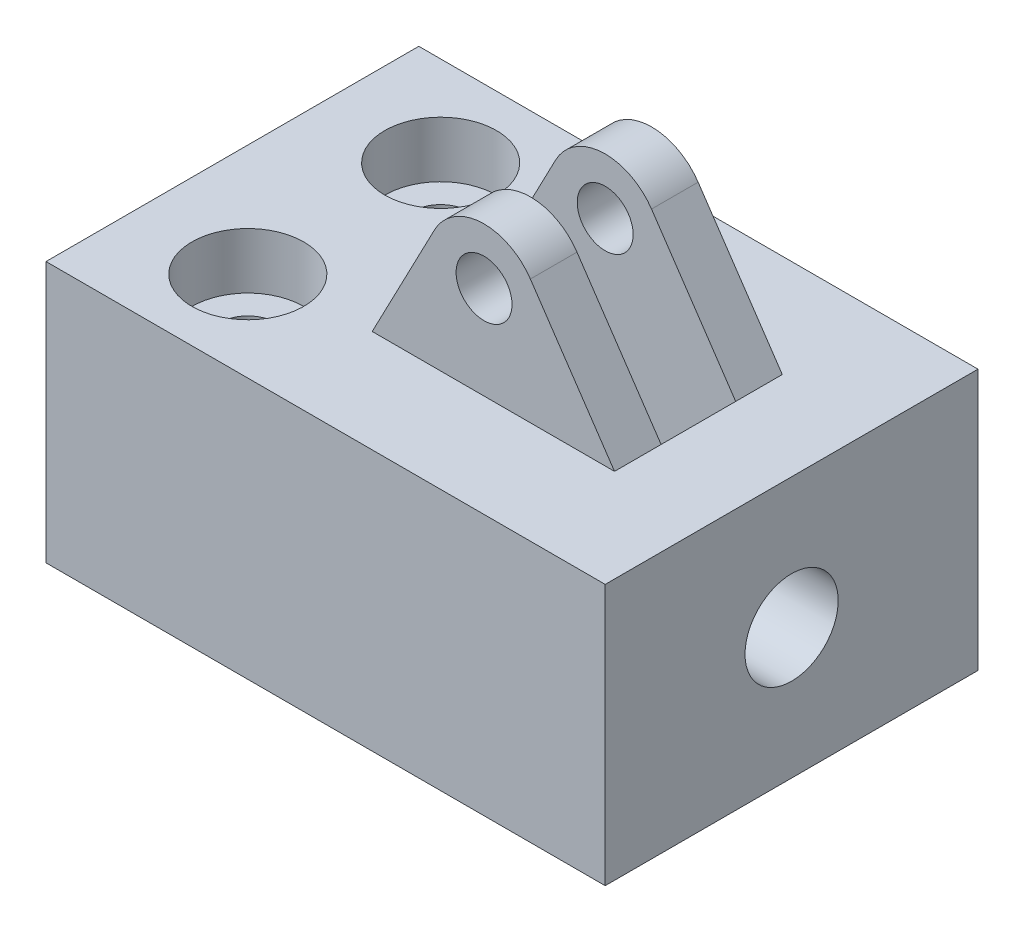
ISO-10303-21;
HEADER;
FILE_DESCRIPTION(('STEP AP214'),'2;1');
FILE_NAME('part.step','',(''),(''),'','','');
FILE_SCHEMA(('AUTOMOTIVE_DESIGN { 1 0 10303 214 1 1 1 1 }'));
ENDSEC;
DATA;
#1=APPLICATION_CONTEXT('core data for automotive mechanical design processes');
#2=APPLICATION_PROTOCOL_DEFINITION('international standard','automotive_design',2000,#1);
#3=PRODUCT_CONTEXT('',#1,'mechanical');
#4=PRODUCT('Part','Part','',(#3));
#5=PRODUCT_RELATED_PRODUCT_CATEGORY('part','',(#4));
#6=PRODUCT_DEFINITION_FORMATION('','',#4);
#7=PRODUCT_DEFINITION_CONTEXT('part definition',#1,'design');
#8=PRODUCT_DEFINITION('design','',#6,#7);
#9=PRODUCT_DEFINITION_SHAPE('','',#8);
#10=(LENGTH_UNIT() NAMED_UNIT(*) SI_UNIT(.MILLI.,.METRE.));
#11=(NAMED_UNIT(*) PLANE_ANGLE_UNIT() SI_UNIT($,.RADIAN.));
#12=(NAMED_UNIT(*) SI_UNIT($,.STERADIAN.) SOLID_ANGLE_UNIT());
#13=UNCERTAINTY_MEASURE_WITH_UNIT(LENGTH_MEASURE(1.E-05),#10,'distance_accuracy_value','');
#14=(GEOMETRIC_REPRESENTATION_CONTEXT(3) GLOBAL_UNCERTAINTY_ASSIGNED_CONTEXT((#13)) GLOBAL_UNIT_ASSIGNED_CONTEXT((#10,
#11,#12)) REPRESENTATION_CONTEXT('',''));
#15=CARTESIAN_POINT('',(0.,0.,0.));
#16=DIRECTION('',(0.,0.,1.));
#17=DIRECTION('',(1.,0.,0.));
#18=AXIS2_PLACEMENT_3D('',#15,#16,#17);
#19=CARTESIAN_POINT('',(-30.,14.,-20.));
#20=DIRECTION('',(0.,1.,0.));
#21=DIRECTION('',(0.,0.,1.));
#22=AXIS2_PLACEMENT_3D('',#19,#20,#21);
#23=PLANE('',#22);
#24=DIRECTION('',(0.,0.,1.));
#25=VECTOR('',#24,1.);
#26=CARTESIAN_POINT('',(20.,14.,-4.));
#27=LINE('',#26,#25);
#28=CARTESIAN_POINT('',(20.,14.,-4.));
#29=VERTEX_POINT('',#28);
#30=CARTESIAN_POINT('',(20.,14.,4.));
#31=VERTEX_POINT('',#30);
#32=EDGE_CURVE('E314',#29,#31,#27,.T.);
#33=ORIENTED_EDGE('',*,*,#32,.T.);
#34=DIRECTION('',(0.,0.,-1.));
#35=VECTOR('',#34,1.);
#36=CARTESIAN_POINT('',(20.,14.,9.));
#37=LINE('',#36,#35);
#38=CARTESIAN_POINT('',(20.,14.,9.));
#39=VERTEX_POINT('',#38);
#40=EDGE_CURVE('E219',#39,#31,#37,.T.);
#41=ORIENTED_EDGE('',*,*,#40,.F.);
#42=DIRECTION('',(1.,0.,0.));
#43=VECTOR('',#42,1.);
#44=CARTESIAN_POINT('',(20.,14.,9.));
#45=LINE('',#44,#43);
#46=CARTESIAN_POINT('',(-6.,14.,9.));
#47=VERTEX_POINT('',#46);
#48=EDGE_CURVE('E207',#47,#39,#45,.T.);
#49=ORIENTED_EDGE('',*,*,#48,.F.);
#50=DIRECTION('',(0.,0.,-1.));
#51=VECTOR('',#50,1.);
#52=CARTESIAN_POINT('',(-6.,14.,9.));
#53=LINE('',#52,#51);
#54=CARTESIAN_POINT('',(-6.,14.,4.));
#55=VERTEX_POINT('',#54);
#56=EDGE_CURVE('E167',#47,#55,#53,.T.);
#57=ORIENTED_EDGE('',*,*,#56,.T.);
#58=DIRECTION('',(0.,0.,1.));
#59=VECTOR('',#58,1.);
#60=CARTESIAN_POINT('',(-6.,14.,-4.));
#61=LINE('',#60,#59);
#62=CARTESIAN_POINT('',(-6.,14.,-4.));
#63=VERTEX_POINT('',#62);
#64=EDGE_CURVE('E146',#63,#55,#61,.T.);
#65=ORIENTED_EDGE('',*,*,#64,.F.);
#66=DIRECTION('',(0.,0.,1.));
#67=VECTOR('',#66,1.);
#68=CARTESIAN_POINT('',(-6.,14.,-9.));
#69=LINE('',#68,#67);
#70=CARTESIAN_POINT('',(-6.,14.,-9.));
#71=VERTEX_POINT('',#70);
#72=EDGE_CURVE('E164',#71,#63,#69,.T.);
#73=ORIENTED_EDGE('',*,*,#72,.F.);
#74=DIRECTION('',(1.,0.,0.));
#75=VECTOR('',#74,1.);
#76=CARTESIAN_POINT('',(20.,14.,-9.));
#77=LINE('',#76,#75);
#78=CARTESIAN_POINT('',(20.,14.,-9.));
#79=VERTEX_POINT('',#78);
#80=EDGE_CURVE('E330',#71,#79,#77,.T.);
#81=ORIENTED_EDGE('',*,*,#80,.T.);
#82=DIRECTION('',(0.,0.,1.));
#83=VECTOR('',#82,1.);
#84=CARTESIAN_POINT('',(20.,14.,-9.));
#85=LINE('',#84,#83);
#86=EDGE_CURVE('E185',#79,#29,#85,.T.);
#87=ORIENTED_EDGE('',*,*,#86,.T.);
#88=EDGE_LOOP('',(#33,#41,#49,#57,#65,#73,#81,#87));
#89=FACE_BOUND('',#88,.T.);
#90=DIRECTION('',(-1.,0.,0.));
#91=VECTOR('',#90,1.);
#92=CARTESIAN_POINT('',(-30.,14.,20.));
#93=LINE('',#92,#91);
#94=CARTESIAN_POINT('',(30.,14.,20.));
#95=VERTEX_POINT('',#94);
#96=CARTESIAN_POINT('',(-30.,14.,20.));
#97=VERTEX_POINT('',#96);
#98=EDGE_CURVE('E266',#95,#97,#93,.T.);
#99=ORIENTED_EDGE('',*,*,#98,.F.);
#100=DIRECTION('',(0.,0.,1.));
#101=VECTOR('',#100,1.);
#102=CARTESIAN_POINT('',(30.,14.,-20.));
#103=LINE('',#102,#101);
#104=CARTESIAN_POINT('',(30.,14.,-20.));
#105=VERTEX_POINT('',#104);
#106=EDGE_CURVE('E289',#105,#95,#103,.T.);
#107=ORIENTED_EDGE('',*,*,#106,.F.);
#108=DIRECTION('',(-1.,0.,0.));
#109=VECTOR('',#108,1.);
#110=CARTESIAN_POINT('',(-30.,14.,-20.));
#111=LINE('',#110,#109);
#112=CARTESIAN_POINT('',(-30.,14.,-20.));
#113=VERTEX_POINT('',#112);
#114=EDGE_CURVE('E272',#105,#113,#111,.T.);
#115=ORIENTED_EDGE('',*,*,#114,.T.);
#116=DIRECTION('',(0.,0.,1.));
#117=VECTOR('',#116,1.);
#118=CARTESIAN_POINT('',(-30.,14.,-20.));
#119=LINE('',#118,#117);
#120=EDGE_CURVE('E286',#113,#97,#119,.T.);
#121=ORIENTED_EDGE('',*,*,#120,.T.);
#122=EDGE_LOOP('',(#99,#107,#115,#121));
#123=FACE_BOUND('',#122,.T.);
#124=CARTESIAN_POINT('',(-18.,14.,-10.344827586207));
#125=DIRECTION('',(0.,1.,0.));
#126=DIRECTION('',(0.,0.,1.));
#127=AXIS2_PLACEMENT_3D('',#124,#125,#126);
#128=CIRCLE('',#127,6.);
#129=CARTESIAN_POINT('',(-18.,14.,-4.344827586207));
#130=VERTEX_POINT('',#129);
#131=EDGE_CURVE('E241',#130,#130,#128,.T.);
#132=ORIENTED_EDGE('',*,*,#131,.F.);
#133=EDGE_LOOP('',(#132));
#134=FACE_BOUND('',#133,.T.);
#135=CARTESIAN_POINT('',(-18.,14.,10.344827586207));
#136=DIRECTION('',(0.,1.,0.));
#137=DIRECTION('',(0.,0.,-1.));
#138=AXIS2_PLACEMENT_3D('',#135,#136,#137);
#139=CIRCLE('',#138,6.);
#140=CARTESIAN_POINT('',(-18.,14.,4.344827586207));
#141=VERTEX_POINT('',#140);
#142=EDGE_CURVE('E235',#141,#141,#139,.T.);
#143=ORIENTED_EDGE('',*,*,#142,.F.);
#144=EDGE_LOOP('',(#143));
#145=FACE_BOUND('',#144,.T.);
#146=ADVANCED_FACE('F31',(#89,#123,#134,#145),#23,.T.);
#147=CARTESIAN_POINT('',(-30.,14.,-20.));
#148=DIRECTION('',(-1.,0.,0.));
#149=DIRECTION('',(0.,0.,1.));
#150=AXIS2_PLACEMENT_3D('',#147,#148,#149);
#151=PLANE('',#150);
#152=CARTESIAN_POINT('',(-30.,0.,0.));
#153=DIRECTION('',(-1.,0.,0.));
#154=DIRECTION('',(0.,0.,1.));
#155=AXIS2_PLACEMENT_3D('',#152,#153,#154);
#156=CIRCLE('',#155,6.);
#157=CARTESIAN_POINT('',(-30.,0.,6.));
#158=VERTEX_POINT('',#157);
#159=EDGE_CURVE('E253',#158,#158,#156,.T.);
#160=ORIENTED_EDGE('',*,*,#159,.F.);
#161=EDGE_LOOP('',(#160));
#162=FACE_BOUND('',#161,.T.);
#163=DIRECTION('',(0.,-1.,0.));
#164=VECTOR('',#163,1.);
#165=CARTESIAN_POINT('',(-30.,14.,20.));
#166=LINE('',#165,#164);
#167=CARTESIAN_POINT('',(-30.,-14.,20.));
#168=VERTEX_POINT('',#167);
#169=EDGE_CURVE('E259',#97,#168,#166,.T.);
#170=ORIENTED_EDGE('',*,*,#169,.F.);
#171=ORIENTED_EDGE('',*,*,#120,.F.);
#172=DIRECTION('',(0.,-1.,0.));
#173=VECTOR('',#172,1.);
#174=CARTESIAN_POINT('',(-30.,14.,-20.));
#175=LINE('',#174,#173);
#176=CARTESIAN_POINT('',(-30.,-14.,-20.));
#177=VERTEX_POINT('',#176);
#178=EDGE_CURVE('E262',#113,#177,#175,.T.);
#179=ORIENTED_EDGE('',*,*,#178,.T.);
#180=DIRECTION('',(0.,0.,1.));
#181=VECTOR('',#180,1.);
#182=CARTESIAN_POINT('',(-30.,-14.,-20.));
#183=LINE('',#182,#181);
#184=EDGE_CURVE('E275',#177,#168,#183,.T.);
#185=ORIENTED_EDGE('',*,*,#184,.T.);
#186=EDGE_LOOP('',(#170,#171,#179,#185));
#187=FACE_BOUND('',#186,.T.);
#188=ADVANCED_FACE('F33',(#162,#187),#151,.T.);
#189=CARTESIAN_POINT('',(30.,14.,-20.));
#190=DIRECTION('',(1.,0.,0.));
#191=DIRECTION('',(0.,0.,-1.));
#192=AXIS2_PLACEMENT_3D('',#189,#190,#191);
#193=PLANE('',#192);
#194=CARTESIAN_POINT('',(30.,0.,0.));
#195=DIRECTION('',(-1.,0.,0.));
#196=DIRECTION('',(0.,0.,1.));
#197=AXIS2_PLACEMENT_3D('',#194,#195,#196);
#198=CIRCLE('',#197,5.);
#199=CARTESIAN_POINT('',(30.,0.,5.));
#200=VERTEX_POINT('',#199);
#201=EDGE_CURVE('E250',#200,#200,#198,.T.);
#202=ORIENTED_EDGE('',*,*,#201,.T.);
#203=EDGE_LOOP('',(#202));
#204=FACE_BOUND('',#203,.T.);
#205=DIRECTION('',(0.,1.,0.));
#206=VECTOR('',#205,1.);
#207=CARTESIAN_POINT('',(30.,14.,20.));
#208=LINE('',#207,#206);
#209=CARTESIAN_POINT('',(30.,-14.,20.));
#210=VERTEX_POINT('',#209);
#211=EDGE_CURVE('E281',#210,#95,#208,.T.);
#212=ORIENTED_EDGE('',*,*,#211,.F.);
#213=DIRECTION('',(0.,0.,1.));
#214=VECTOR('',#213,1.);
#215=CARTESIAN_POINT('',(30.,-14.,-20.));
#216=LINE('',#215,#214);
#217=CARTESIAN_POINT('',(30.,-14.,-20.));
#218=VERTEX_POINT('',#217);
#219=EDGE_CURVE('E291',#218,#210,#216,.T.);
#220=ORIENTED_EDGE('',*,*,#219,.F.);
#221=DIRECTION('',(0.,1.,0.));
#222=VECTOR('',#221,1.);
#223=CARTESIAN_POINT('',(30.,14.,-20.));
#224=LINE('',#223,#222);
#225=EDGE_CURVE('E269',#218,#105,#224,.T.);
#226=ORIENTED_EDGE('',*,*,#225,.T.);
#227=ORIENTED_EDGE('',*,*,#106,.T.);
#228=EDGE_LOOP('',(#212,#220,#226,#227));
#229=FACE_BOUND('',#228,.T.);
#230=ADVANCED_FACE('F362',(#204,#229),#193,.T.);
#231=CARTESIAN_POINT('',(-30.,-14.,-20.));
#232=DIRECTION('',(0.,-1.,0.));
#233=DIRECTION('',(0.,0.,-1.));
#234=AXIS2_PLACEMENT_3D('',#231,#232,#233);
#235=PLANE('',#234);
#236=CARTESIAN_POINT('',(-18.,-14.,-10.344827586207));
#237=DIRECTION('',(0.,1.,0.));
#238=DIRECTION('',(0.,0.,-1.));
#239=AXIS2_PLACEMENT_3D('',#236,#237,#238);
#240=CIRCLE('',#239,3.);
#241=CARTESIAN_POINT('',(-18.,-14.,-13.344827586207));
#242=VERTEX_POINT('',#241);
#243=EDGE_CURVE('E226',#242,#242,#240,.T.);
#244=ORIENTED_EDGE('',*,*,#243,.T.);
#245=EDGE_LOOP('',(#244));
#246=FACE_BOUND('',#245,.T.);
#247=CARTESIAN_POINT('',(-18.,-14.,10.344827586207));
#248=DIRECTION('',(0.,1.,0.));
#249=DIRECTION('',(0.,0.,1.));
#250=AXIS2_PLACEMENT_3D('',#247,#248,#249);
#251=CIRCLE('',#250,3.);
#252=CARTESIAN_POINT('',(-18.,-14.,13.344827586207));
#253=VERTEX_POINT('',#252);
#254=EDGE_CURVE('E232',#253,#253,#251,.T.);
#255=ORIENTED_EDGE('',*,*,#254,.T.);
#256=EDGE_LOOP('',(#255));
#257=FACE_BOUND('',#256,.T.);
#258=DIRECTION('',(1.,0.,0.));
#259=VECTOR('',#258,1.);
#260=CARTESIAN_POINT('',(-30.,-14.,20.));
#261=LINE('',#260,#259);
#262=EDGE_CURVE('E278',#168,#210,#261,.T.);
#263=ORIENTED_EDGE('',*,*,#262,.F.);
#264=ORIENTED_EDGE('',*,*,#184,.F.);
#265=DIRECTION('',(1.,0.,0.));
#266=VECTOR('',#265,1.);
#267=CARTESIAN_POINT('',(-30.,-14.,-20.));
#268=LINE('',#267,#266);
#269=EDGE_CURVE('E265',#177,#218,#268,.T.);
#270=ORIENTED_EDGE('',*,*,#269,.T.);
#271=ORIENTED_EDGE('',*,*,#219,.T.);
#272=EDGE_LOOP('',(#263,#264,#270,#271));
#273=FACE_BOUND('',#272,.T.);
#274=ADVANCED_FACE('F369',(#246,#257,#273),#235,.T.);
#275=CARTESIAN_POINT('',(-30.,-14.,-20.));
#276=DIRECTION('',(0.,0.,1.));
#277=DIRECTION('',(1.,0.,0.));
#278=AXIS2_PLACEMENT_3D('',#275,#276,#277);
#279=PLANE('',#278);
#280=CARTESIAN_POINT('',(6.,0.,-20.));
#281=DIRECTION('',(0.,0.,-1.));
#282=DIRECTION('',(-1.,0.,0.));
#283=AXIS2_PLACEMENT_3D('',#280,#281,#282);
#284=CIRCLE('',#283,2.5);
#285=CARTESIAN_POINT('',(3.5,0.,-20.));
#286=VERTEX_POINT('',#285);
#287=EDGE_CURVE('E679',#286,#286,#284,.T.);
#288=ORIENTED_EDGE('',*,*,#287,.F.);
#289=EDGE_LOOP('',(#288));
#290=FACE_BOUND('',#289,.T.);
#291=ORIENTED_EDGE('',*,*,#178,.F.);
#292=ORIENTED_EDGE('',*,*,#114,.F.);
#293=ORIENTED_EDGE('',*,*,#225,.F.);
#294=ORIENTED_EDGE('',*,*,#269,.F.);
#295=EDGE_LOOP('',(#291,#292,#293,#294));
#296=FACE_BOUND('',#295,.T.);
#297=ADVANCED_FACE('F372',(#290,#296),#279,.F.);
#298=CARTESIAN_POINT('',(-30.,-14.,20.));
#299=DIRECTION('',(0.,0.,1.));
#300=DIRECTION('',(1.,0.,0.));
#301=AXIS2_PLACEMENT_3D('',#298,#299,#300);
#302=PLANE('',#301);
#303=ORIENTED_EDGE('',*,*,#169,.T.);
#304=ORIENTED_EDGE('',*,*,#262,.T.);
#305=ORIENTED_EDGE('',*,*,#211,.T.);
#306=ORIENTED_EDGE('',*,*,#98,.T.);
#307=EDGE_LOOP('',(#303,#304,#305,#306));
#308=FACE_BOUND('',#307,.T.);
#309=ADVANCED_FACE('F366',(#308),#302,.T.);
#310=CARTESIAN_POINT('',(-14.,0.,0.));
#311=DIRECTION('',(-1.,0.,0.));
#312=DIRECTION('',(0.,0.,1.));
#313=AXIS2_PLACEMENT_3D('',#310,#311,#312);
#314=CYLINDRICAL_SURFACE('',#313,6.);
#315=CARTESIAN_POINT('',(-14.,0.,0.));
#316=DIRECTION('',(-1.,0.,0.));
#317=DIRECTION('',(0.,0.,1.));
#318=AXIS2_PLACEMENT_3D('',#315,#316,#317);
#319=CIRCLE('',#318,6.);
#320=CARTESIAN_POINT('',(-14.,0.,6.));
#321=VERTEX_POINT('',#320);
#322=EDGE_CURVE('E256',#321,#321,#319,.T.);
#323=ORIENTED_EDGE('',*,*,#322,.F.);
#324=EDGE_LOOP('',(#323));
#325=FACE_BOUND('',#324,.T.);
#326=ORIENTED_EDGE('',*,*,#159,.T.);
#327=EDGE_LOOP('',(#326));
#328=FACE_BOUND('',#327,.T.);
#329=ADVANCED_FACE('F427',(#325,#328),#314,.F.);
#330=CARTESIAN_POINT('',(-14.,0.,0.));
#331=DIRECTION('',(-1.,0.,0.));
#332=DIRECTION('',(0.,0.,1.));
#333=AXIS2_PLACEMENT_3D('',#330,#331,#332);
#334=PLANE('',#333);
#335=CARTESIAN_POINT('',(-14.,0.,0.));
#336=DIRECTION('',(-1.,0.,0.));
#337=DIRECTION('',(0.,0.,1.));
#338=AXIS2_PLACEMENT_3D('',#335,#336,#337);
#339=CIRCLE('',#338,5.);
#340=CARTESIAN_POINT('',(-14.,0.,5.));
#341=VERTEX_POINT('',#340);
#342=EDGE_CURVE('E247',#341,#341,#339,.T.);
#343=ORIENTED_EDGE('',*,*,#342,.F.);
#344=EDGE_LOOP('',(#343));
#345=FACE_BOUND('',#344,.T.);
#346=ORIENTED_EDGE('',*,*,#322,.T.);
#347=EDGE_LOOP('',(#346));
#348=FACE_BOUND('',#347,.T.);
#349=ADVANCED_FACE('F423',(#345,#348),#334,.T.);
#350=CARTESIAN_POINT('',(30.,0.,0.));
#351=DIRECTION('',(-1.,0.,0.));
#352=DIRECTION('',(0.,0.,1.));
#353=AXIS2_PLACEMENT_3D('',#350,#351,#352);
#354=CYLINDRICAL_SURFACE('',#353,5.);
#355=CARTESIAN_POINT('',(3.5,0.,-5.));
#356=CARTESIAN_POINT('',(3.50000966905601,-0.131426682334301,-4.99999177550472));
#357=CARTESIAN_POINT('',(3.51042556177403,-0.263015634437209,-4.99476199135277));
#358=CARTESIAN_POINT('',(3.55163182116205,-0.522301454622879,-4.9743541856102));
#359=CARTESIAN_POINT('',(3.58246088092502,-0.649990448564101,-4.9591572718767));
#360=CARTESIAN_POINT('',(3.66298462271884,-0.897333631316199,-4.92040690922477));
#361=CARTESIAN_POINT('',(3.71260598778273,-1.01701694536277,-4.89688595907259));
#362=CARTESIAN_POINT('',(3.82892652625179,-1.2461816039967,-4.84364443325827));
#363=CARTESIAN_POINT('',(3.89562435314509,-1.35566375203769,-4.81392434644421));
#364=CARTESIAN_POINT('',(4.04879313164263,-1.56876952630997,-4.74890645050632));
#365=CARTESIAN_POINT('',(4.13621620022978,-1.67163802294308,-4.71337997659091));
#366=CARTESIAN_POINT('',(4.32630369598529,-1.86194861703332,-4.64149925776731));
#367=CARTESIAN_POINT('',(4.42897962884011,-1.94937895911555,-4.60514440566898));
#368=CARTESIAN_POINT('',(4.65620837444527,-2.11312999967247,-4.53247377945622));
#369=CARTESIAN_POINT('',(4.781840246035,-2.18806333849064,-4.49637967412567));
#370=CARTESIAN_POINT('',(5.04591833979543,-2.31542056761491,-4.43214946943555));
#371=CARTESIAN_POINT('',(5.18435532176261,-2.36786053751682,-4.40400769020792));
#372=CARTESIAN_POINT('',(5.46166276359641,-2.44533110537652,-4.36144667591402));
#373=CARTESIAN_POINT('',(5.60001113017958,-2.47181464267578,-4.34630678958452));
#374=CARTESIAN_POINT('',(5.8799470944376,-2.50106748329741,-4.3295472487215));
#375=CARTESIAN_POINT('',(6.02153135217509,-2.50386022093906,-4.3279142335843));
#376=CARTESIAN_POINT('',(6.28571506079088,-2.48671821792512,-4.33777325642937));
#377=CARTESIAN_POINT('',(6.40856007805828,-2.46946139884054,-4.34771909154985));
#378=CARTESIAN_POINT('',(6.64930477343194,-2.41734962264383,-4.37690571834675));
#379=CARTESIAN_POINT('',(6.76720286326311,-2.38248905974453,-4.39614947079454));
#380=CARTESIAN_POINT('',(6.99807283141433,-2.29552445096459,-4.44218691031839));
#381=CARTESIAN_POINT('',(7.11086599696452,-2.24303766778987,-4.46914601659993));
#382=CARTESIAN_POINT('',(7.32658573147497,-2.12260421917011,-4.52758510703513));
#383=CARTESIAN_POINT('',(7.42950783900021,-2.0546506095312,-4.55906711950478));
#384=CARTESIAN_POINT('',(7.63630313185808,-1.89516513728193,-4.62782894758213));
#385=CARTESIAN_POINT('',(7.7386421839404,-1.80173614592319,-4.66533775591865));
#386=CARTESIAN_POINT('',(7.92683854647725,-1.59888894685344,-4.73869058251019));
#387=CARTESIAN_POINT('',(8.0126879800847,-1.48946314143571,-4.77453379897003));
#388=CARTESIAN_POINT('',(8.16921415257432,-1.25129126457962,-4.84254968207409));
#389=CARTESIAN_POINT('',(8.23900118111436,-1.12188397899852,-4.87447460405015));
#390=CARTESIAN_POINT('',(8.35524257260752,-0.851165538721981,-4.92894702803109));
#391=CARTESIAN_POINT('',(8.4017154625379,-0.709863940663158,-4.95150197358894));
#392=CARTESIAN_POINT('',(8.4661885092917,-0.431916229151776,-4.98310834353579));
#393=CARTESIAN_POINT('',(8.486228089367,-0.295853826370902,-4.9931234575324));
#394=CARTESIAN_POINT('',(8.50366182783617,-0.0219489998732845,-5.00182533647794));
#395=CARTESIAN_POINT('',(8.5010667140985,0.115892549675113,-5.00051746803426));
#396=CARTESIAN_POINT('',(8.4744832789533,0.37808242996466,-4.98727980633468));
#397=CARTESIAN_POINT('',(8.45216866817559,0.50264852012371,-4.97618114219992));
#398=CARTESIAN_POINT('',(8.38940482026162,0.746017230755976,-4.94555428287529));
#399=CARTESIAN_POINT('',(8.3489535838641,0.864819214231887,-4.92602515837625));
#400=CARTESIAN_POINT('',(8.25000383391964,1.09722152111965,-4.87960628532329));
#401=CARTESIAN_POINT('',(8.19102237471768,1.21057599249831,-4.85252204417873));
#402=CARTESIAN_POINT('',(8.05723116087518,1.42615340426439,-4.7935993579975));
#403=CARTESIAN_POINT('',(7.98241466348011,1.52837157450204,-4.76175888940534));
#404=CARTESIAN_POINT('',(7.81059893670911,1.72941922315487,-4.69270553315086));
#405=CARTESIAN_POINT('',(7.7121428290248,1.82693019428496,-4.65527212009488));
#406=CARTESIAN_POINT('',(7.50018712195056,2.0046408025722,-4.58155978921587));
#407=CARTESIAN_POINT('',(7.38667720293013,2.08482846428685,-4.54528168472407));
#408=CARTESIAN_POINT('',(7.14089086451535,2.22926978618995,-4.4762798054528));
#409=CARTESIAN_POINT('',(7.00797183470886,2.29256373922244,-4.44381323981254));
#410=CARTESIAN_POINT('',(6.73122483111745,2.39520706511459,-4.38935180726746));
#411=CARTESIAN_POINT('',(6.58741118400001,2.43458729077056,-4.36734345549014));
#412=CARTESIAN_POINT('',(6.30772444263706,2.48465421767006,-4.33903752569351));
#413=CARTESIAN_POINT('',(6.17241436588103,2.49773248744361,-4.33143458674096));
#414=CARTESIAN_POINT('',(5.90138233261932,2.50172288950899,-4.32913386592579));
#415=CARTESIAN_POINT('',(5.76566058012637,2.49264462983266,-4.3344304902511));
#416=CARTESIAN_POINT('',(5.51129124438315,2.45481530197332,-4.35594655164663));
#417=CARTESIAN_POINT('',(5.39224881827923,2.42802074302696,-4.37107736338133));
#418=CARTESIAN_POINT('',(5.16047970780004,2.35793843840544,-4.40927540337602));
#419=CARTESIAN_POINT('',(5.04775506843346,2.31464538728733,-4.43234518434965));
#420=CARTESIAN_POINT('',(4.82343784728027,2.20953919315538,-4.48571326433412));
#421=CARTESIAN_POINT('',(4.71243014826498,2.14667719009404,-4.5163930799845));
#422=CARTESIAN_POINT('',(4.50181375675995,2.0053780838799,-4.58088327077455));
#423=CARTESIAN_POINT('',(4.40221103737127,1.92693287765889,-4.61469526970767));
#424=CARTESIAN_POINT('',(4.20464463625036,1.74550556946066,-4.68655816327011));
#425=CARTESIAN_POINT('',(4.10835063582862,1.6407002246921,-4.7246249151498));
#426=CARTESIAN_POINT('',(3.93434415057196,1.41539785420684,-4.79694347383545));
#427=CARTESIAN_POINT('',(3.85664168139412,1.29489242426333,-4.83119321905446));
#428=CARTESIAN_POINT('',(3.7219030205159,1.03978808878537,-4.89245149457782));
#429=CARTESIAN_POINT('',(3.66501683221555,0.905095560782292,-4.91940711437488));
#430=CARTESIAN_POINT('',(3.5978161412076,0.696328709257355,-4.9517796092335));
#431=CARTESIAN_POINT('',(3.57844460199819,0.625670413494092,-4.96122314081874));
#432=CARTESIAN_POINT('',(3.5459340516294,0.482623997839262,-4.97717127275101));
#433=CARTESIAN_POINT('',(3.53279123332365,0.410236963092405,-4.98367766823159));
#434=CARTESIAN_POINT('',(3.51526252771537,0.281518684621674,-4.9923820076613));
#435=CARTESIAN_POINT('',(3.50954506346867,0.225408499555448,-4.99523288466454));
#436=CARTESIAN_POINT('',(3.50191167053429,0.112875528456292,-4.99904367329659));
#437=CARTESIAN_POINT('',(3.49999584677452,0.0564527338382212,-5.00000353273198));
#438=CARTESIAN_POINT('',(3.5,0.,-5.));
#439=B_SPLINE_CURVE_WITH_KNOTS('',3,(#355,#356,#357,#358,#359,#360,#361,#362,#363,#364,#365,
#366,#367,#368,#369,#370,#371,#372,#373,#374,#375,#376,#377,#378,#379,#380,#381,#382,#383,#384,
#385,#386,#387,#388,#389,#390,#391,#392,#393,#394,#395,#396,#397,#398,#399,#400,#401,#402,#403,
#404,#405,#406,#407,#408,#409,#410,#411,#412,#413,#414,#415,#416,#417,#418,#419,#420,#421,#422,
#423,#424,#425,#426,#427,#428,#429,#430,#431,#432,#433,#434,#435,#436,#437,#438),.UNSPECIFIED.,
.T.,.F.,(4,2,2,2,2,2,2,2,2,2,2,2,2,2,2,2,2,2,2,2,2,2,2,2,2,2,2,2,2,2,2,2,2,2,2,2,2,2,2,2,2,4),
(0.,0.394060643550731,0.788870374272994,1.18215538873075,1.57540940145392,1.99245439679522,
2.40981559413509,2.85954316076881,3.30894869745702,3.73145030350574,4.15353393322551,
4.52514281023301,4.89687009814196,5.27725600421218,5.65781303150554,6.08662353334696,
6.51563836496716,6.96457555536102,7.41315542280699,7.82458226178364,8.2358141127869,
8.61517266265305,8.99457304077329,9.38482140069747,9.77523626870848,10.2039902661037,
10.6330397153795,11.0828670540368,11.53211279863,11.9382326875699,12.3441764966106,
12.7114482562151,13.0788382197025,13.4709114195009,13.8631890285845,14.303131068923,
14.7433095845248,15.1866003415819,15.407934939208,15.6291340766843,15.7983933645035,
15.9676573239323),.UNSPECIFIED.);
#440=CARTESIAN_POINT('',(3.5,0.,-5.));
#441=VERTEX_POINT('',#440);
#442=EDGE_CURVE('E675',#441,#441,#439,.T.);
#443=ORIENTED_EDGE('',*,*,#442,.F.);
#444=EDGE_LOOP('',(#443));
#445=FACE_BOUND('',#444,.T.);
#446=DIRECTION('',(-1.,0.,0.));
#447=VECTOR('',#446,1.);
#448=CARTESIAN_POINT('',(30.,4.,3.));
#449=LINE('',#448,#447);
#450=CARTESIAN_POINT('',(-6.,4.,3.));
#451=VERTEX_POINT('',#450);
#452=CARTESIAN_POINT('',(26.7582667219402,4.,3.));
#453=VERTEX_POINT('',#452);
#454=EDGE_CURVE('E39',#451,#453,#449,.F.);
#455=ORIENTED_EDGE('',*,*,#454,.T.);
#456=CARTESIAN_POINT('',(29.4615734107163,0.,0.));
#457=DIRECTION('',(0.828530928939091,0.559943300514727,0.));
#458=DIRECTION('',(-0.559943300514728,0.828530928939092,0.));
#459=AXIS2_PLACEMENT_3D('',#456,#457,#458);
#460=ELLIPSE('',#459,6.03477773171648,5.);
#461=CARTESIAN_POINT('',(26.7582667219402,4.,-3.));
#462=VERTEX_POINT('',#461);
#463=EDGE_CURVE('E11',#453,#462,#460,.F.);
#464=ORIENTED_EDGE('',*,*,#463,.T.);
#465=DIRECTION('',(-1.,0.,0.));
#466=VECTOR('',#465,1.);
#467=CARTESIAN_POINT('',(30.,4.,-3.));
#468=LINE('',#467,#466);
#469=CARTESIAN_POINT('',(-6.,4.,-3.));
#470=VERTEX_POINT('',#469);
#471=EDGE_CURVE('E296',#462,#470,#468,.T.);
#472=ORIENTED_EDGE('',*,*,#471,.T.);
#473=CARTESIAN_POINT('',(-6.,0.,0.));
#474=DIRECTION('',(-1.,0.,0.));
#475=DIRECTION('',(0.,-1.,0.));
#476=AXIS2_PLACEMENT_3D('',#473,#474,#475);
#477=CIRCLE('',#476,5.);
#478=EDGE_CURVE('E288',#470,#451,#477,.F.);
#479=ORIENTED_EDGE('',*,*,#478,.T.);
#480=EDGE_LOOP('',(#455,#464,#472,#479));
#481=FACE_BOUND('',#480,.T.);
#482=ORIENTED_EDGE('',*,*,#201,.F.);
#483=EDGE_LOOP('',(#482));
#484=FACE_BOUND('',#483,.T.);
#485=ORIENTED_EDGE('',*,*,#342,.T.);
#486=EDGE_LOOP('',(#485));
#487=FACE_BOUND('',#486,.T.);
#488=ADVANCED_FACE('F300',(#445,#481,#484,#487),#354,.F.);
#489=CARTESIAN_POINT('',(-18.,8.,-10.344827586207));
#490=DIRECTION('',(0.,1.,0.));
#491=DIRECTION('',(0.,0.,1.));
#492=AXIS2_PLACEMENT_3D('',#489,#490,#491);
#493=CYLINDRICAL_SURFACE('',#492,6.);
#494=CARTESIAN_POINT('',(-18.,8.,-10.344827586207));
#495=DIRECTION('',(0.,1.,0.));
#496=DIRECTION('',(0.,0.,1.));
#497=AXIS2_PLACEMENT_3D('',#494,#495,#496);
#498=CIRCLE('',#497,6.);
#499=CARTESIAN_POINT('',(-18.,8.,-4.344827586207));
#500=VERTEX_POINT('',#499);
#501=EDGE_CURVE('E244',#500,#500,#498,.T.);
#502=ORIENTED_EDGE('',*,*,#501,.F.);
#503=EDGE_LOOP('',(#502));
#504=FACE_BOUND('',#503,.T.);
#505=ORIENTED_EDGE('',*,*,#131,.T.);
#506=EDGE_LOOP('',(#505));
#507=FACE_BOUND('',#506,.T.);
#508=ADVANCED_FACE('F412',(#504,#507),#493,.F.);
#509=CARTESIAN_POINT('',(-18.,8.,-10.344827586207));
#510=DIRECTION('',(0.,1.,0.));
#511=DIRECTION('',(0.,0.,1.));
#512=AXIS2_PLACEMENT_3D('',#509,#510,#511);
#513=PLANE('',#512);
#514=CARTESIAN_POINT('',(-18.,8.,-10.344827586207));
#515=DIRECTION('',(0.,1.,0.));
#516=DIRECTION('',(0.,0.,-1.));
#517=AXIS2_PLACEMENT_3D('',#514,#515,#516);
#518=CIRCLE('',#517,3.);
#519=CARTESIAN_POINT('',(-18.,8.,-13.344827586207));
#520=VERTEX_POINT('',#519);
#521=EDGE_CURVE('E225',#520,#520,#518,.T.);
#522=ORIENTED_EDGE('',*,*,#521,.F.);
#523=EDGE_LOOP('',(#522));
#524=FACE_BOUND('',#523,.T.);
#525=ORIENTED_EDGE('',*,*,#501,.T.);
#526=EDGE_LOOP('',(#525));
#527=FACE_BOUND('',#526,.T.);
#528=ADVANCED_FACE('F402',(#524,#527),#513,.T.);
#529=CARTESIAN_POINT('',(-18.,8.,10.344827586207));
#530=DIRECTION('',(0.,1.,0.));
#531=DIRECTION('',(0.,0.,1.));
#532=AXIS2_PLACEMENT_3D('',#529,#530,#531);
#533=CYLINDRICAL_SURFACE('',#532,6.);
#534=CARTESIAN_POINT('',(-18.,8.,10.344827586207));
#535=DIRECTION('',(0.,1.,0.));
#536=DIRECTION('',(0.,0.,-1.));
#537=AXIS2_PLACEMENT_3D('',#534,#535,#536);
#538=CIRCLE('',#537,6.);
#539=CARTESIAN_POINT('',(-18.,8.,4.344827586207));
#540=VERTEX_POINT('',#539);
#541=EDGE_CURVE('E238',#540,#540,#538,.T.);
#542=ORIENTED_EDGE('',*,*,#541,.F.);
#543=EDGE_LOOP('',(#542));
#544=FACE_BOUND('',#543,.T.);
#545=ORIENTED_EDGE('',*,*,#142,.T.);
#546=EDGE_LOOP('',(#545));
#547=FACE_BOUND('',#546,.T.);
#548=ADVANCED_FACE('F399',(#544,#547),#533,.F.);
#549=CARTESIAN_POINT('',(-18.,8.,10.344827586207));
#550=DIRECTION('',(0.,-1.,0.));
#551=DIRECTION('',(0.,0.,-1.));
#552=AXIS2_PLACEMENT_3D('',#549,#550,#551);
#553=PLANE('',#552);
#554=CARTESIAN_POINT('',(-18.,8.,10.344827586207));
#555=DIRECTION('',(0.,1.,0.));
#556=DIRECTION('',(0.,0.,1.));
#557=AXIS2_PLACEMENT_3D('',#554,#555,#556);
#558=CIRCLE('',#557,3.);
#559=CARTESIAN_POINT('',(-18.,8.,13.344827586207));
#560=VERTEX_POINT('',#559);
#561=EDGE_CURVE('E229',#560,#560,#558,.T.);
#562=ORIENTED_EDGE('',*,*,#561,.F.);
#563=EDGE_LOOP('',(#562));
#564=FACE_BOUND('',#563,.T.);
#565=ORIENTED_EDGE('',*,*,#541,.T.);
#566=EDGE_LOOP('',(#565));
#567=FACE_BOUND('',#566,.T.);
#568=ADVANCED_FACE('F401',(#564,#567),#553,.F.);
#569=CARTESIAN_POINT('',(-18.,-14.,10.344827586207));
#570=DIRECTION('',(0.,1.,0.));
#571=DIRECTION('',(0.,0.,1.));
#572=AXIS2_PLACEMENT_3D('',#569,#570,#571);
#573=CYLINDRICAL_SURFACE('',#572,3.);
#574=ORIENTED_EDGE('',*,*,#254,.F.);
#575=EDGE_LOOP('',(#574));
#576=FACE_BOUND('',#575,.T.);
#577=ORIENTED_EDGE('',*,*,#561,.T.);
#578=EDGE_LOOP('',(#577));
#579=FACE_BOUND('',#578,.T.);
#580=ADVANCED_FACE('F409',(#576,#579),#573,.F.);
#581=CARTESIAN_POINT('',(-18.,-14.,-10.344827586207));
#582=DIRECTION('',(0.,1.,0.));
#583=DIRECTION('',(0.,0.,1.));
#584=AXIS2_PLACEMENT_3D('',#581,#582,#583);
#585=CYLINDRICAL_SURFACE('',#584,3.);
#586=ORIENTED_EDGE('',*,*,#243,.F.);
#587=EDGE_LOOP('',(#586));
#588=FACE_BOUND('',#587,.T.);
#589=ORIENTED_EDGE('',*,*,#521,.T.);
#590=EDGE_LOOP('',(#589));
#591=FACE_BOUND('',#590,.T.);
#592=ADVANCED_FACE('F570',(#588,#591),#585,.F.);
#593=CARTESIAN_POINT('',(6.,24.,9.));
#594=DIRECTION('',(0.,0.,1.));
#595=DIRECTION('',(1.,0.,0.));
#596=AXIS2_PLACEMENT_3D('',#593,#594,#595);
#597=PLANE('',#596);
#598=CARTESIAN_POINT('',(6.,24.,9.));
#599=DIRECTION('',(0.,0.,1.));
#600=DIRECTION('',(1.,0.,0.));
#601=AXIS2_PLACEMENT_3D('',#598,#599,#600);
#602=CIRCLE('',#601,6.);
#603=CARTESIAN_POINT('',(10.9711855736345,27.3596598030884,9.));
#604=VERTEX_POINT('',#603);
#605=CARTESIAN_POINT('',(0.683064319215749,26.7803228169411,9.));
#606=VERTEX_POINT('',#605);
#607=EDGE_CURVE('E201',#604,#606,#602,.T.);
#608=ORIENTED_EDGE('',*,*,#607,.T.);
#609=DIRECTION('',(-0.46338713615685,-0.886155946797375,0.));
#610=VECTOR('',#609,1.);
#611=CARTESIAN_POINT('',(0.683064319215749,26.7803228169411,9.));
#612=LINE('',#611,#610);
#613=EDGE_CURVE('E204',#606,#47,#612,.T.);
#614=ORIENTED_EDGE('',*,*,#613,.T.);
#615=ORIENTED_EDGE('',*,*,#48,.T.);
#616=DIRECTION('',(-0.559943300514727,0.828530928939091,0.));
#617=VECTOR('',#616,1.);
#618=CARTESIAN_POINT('',(10.9711855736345,27.3596598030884,9.));
#619=LINE('',#618,#617);
#620=EDGE_CURVE('E54',#39,#604,#619,.T.);
#621=ORIENTED_EDGE('',*,*,#620,.T.);
#622=EDGE_LOOP('',(#608,#614,#615,#621));
#623=FACE_BOUND('',#622,.T.);
#624=CARTESIAN_POINT('',(6.,24.,9.));
#625=DIRECTION('',(0.,0.,1.));
#626=DIRECTION('',(1.,0.,0.));
#627=AXIS2_PLACEMENT_3D('',#624,#625,#626);
#628=CIRCLE('',#627,3.);
#629=CARTESIAN_POINT('',(9.,24.,9.));
#630=VERTEX_POINT('',#629);
#631=EDGE_CURVE('E195',#630,#630,#628,.T.);
#632=ORIENTED_EDGE('',*,*,#631,.F.);
#633=EDGE_LOOP('',(#632));
#634=FACE_BOUND('',#633,.T.);
#635=ADVANCED_FACE('F556',(#623,#634),#597,.T.);
#636=CARTESIAN_POINT('',(6.,24.,4.));
#637=DIRECTION('',(0.,0.,1.));
#638=DIRECTION('',(1.,0.,0.));
#639=AXIS2_PLACEMENT_3D('',#636,#637,#638);
#640=PLANE('',#639);
#641=CARTESIAN_POINT('',(6.,24.,4.));
#642=DIRECTION('',(0.,0.,1.));
#643=DIRECTION('',(1.,0.,0.));
#644=AXIS2_PLACEMENT_3D('',#641,#642,#643);
#645=CIRCLE('',#644,6.);
#646=CARTESIAN_POINT('',(10.9711855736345,27.3596598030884,4.));
#647=VERTEX_POINT('',#646);
#648=CARTESIAN_POINT('',(0.683064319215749,26.7803228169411,4.));
#649=VERTEX_POINT('',#648);
#650=EDGE_CURVE('E198',#647,#649,#645,.T.);
#651=ORIENTED_EDGE('',*,*,#650,.F.);
#652=DIRECTION('',(-0.559943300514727,0.828530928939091,0.));
#653=VECTOR('',#652,1.);
#654=CARTESIAN_POINT('',(10.9711855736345,27.3596598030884,4.));
#655=LINE('',#654,#653);
#656=EDGE_CURVE('E205',#31,#647,#655,.T.);
#657=ORIENTED_EDGE('',*,*,#656,.F.);
#658=DIRECTION('',(-0.559943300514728,0.828530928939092,0.));
#659=VECTOR('',#658,1.);
#660=CARTESIAN_POINT('',(20.,14.,4.));
#661=LINE('',#660,#659);
#662=CARTESIAN_POINT('',(26.7582667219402,4.,4.));
#663=VERTEX_POINT('',#662);
#664=EDGE_CURVE('E155',#663,#31,#661,.T.);
#665=ORIENTED_EDGE('',*,*,#664,.F.);
#666=DIRECTION('',(1.,0.,0.));
#667=VECTOR('',#666,1.);
#668=CARTESIAN_POINT('',(26.7582667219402,4.,4.));
#669=LINE('',#668,#667);
#670=CARTESIAN_POINT('',(-6.,4.,4.));
#671=VERTEX_POINT('',#670);
#672=EDGE_CURVE('E308',#671,#663,#669,.T.);
#673=ORIENTED_EDGE('',*,*,#672,.F.);
#674=DIRECTION('',(0.,-1.,0.));
#675=VECTOR('',#674,1.);
#676=CARTESIAN_POINT('',(-6.,14.,4.));
#677=LINE('',#676,#675);
#678=EDGE_CURVE('E670',#55,#671,#677,.T.);
#679=ORIENTED_EDGE('',*,*,#678,.F.);
#680=DIRECTION('',(-0.46338713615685,-0.886155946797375,0.));
#681=VECTOR('',#680,1.);
#682=CARTESIAN_POINT('',(0.683064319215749,26.7803228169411,4.));
#683=LINE('',#682,#681);
#684=EDGE_CURVE('E213',#649,#55,#683,.T.);
#685=ORIENTED_EDGE('',*,*,#684,.F.);
#686=EDGE_LOOP('',(#651,#657,#665,#673,#679,#685));
#687=FACE_BOUND('',#686,.T.);
#688=CARTESIAN_POINT('',(6.,24.,4.));
#689=DIRECTION('',(0.,0.,1.));
#690=DIRECTION('',(1.,0.,0.));
#691=AXIS2_PLACEMENT_3D('',#688,#689,#690);
#692=CIRCLE('',#691,3.);
#693=CARTESIAN_POINT('',(9.,24.,4.));
#694=VERTEX_POINT('',#693);
#695=EDGE_CURVE('E194',#694,#694,#692,.T.);
#696=ORIENTED_EDGE('',*,*,#695,.T.);
#697=EDGE_LOOP('',(#696));
#698=FACE_BOUND('',#697,.T.);
#699=ADVANCED_FACE('F552',(#687,#698),#640,.F.);
#700=CARTESIAN_POINT('',(6.,24.,9.));
#701=DIRECTION('',(0.,0.,-1.));
#702=DIRECTION('',(-1.,0.,0.));
#703=AXIS2_PLACEMENT_3D('',#700,#701,#702);
#704=CYLINDRICAL_SURFACE('',#703,6.);
#705=ORIENTED_EDGE('',*,*,#650,.T.);
#706=DIRECTION('',(0.,0.,-1.));
#707=VECTOR('',#706,1.);
#708=CARTESIAN_POINT('',(0.683064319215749,26.7803228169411,9.));
#709=LINE('',#708,#707);
#710=EDGE_CURVE('E222',#606,#649,#709,.T.);
#711=ORIENTED_EDGE('',*,*,#710,.F.);
#712=ORIENTED_EDGE('',*,*,#607,.F.);
#713=DIRECTION('',(0.,0.,-1.));
#714=VECTOR('',#713,1.);
#715=CARTESIAN_POINT('',(10.9711855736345,27.3596598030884,9.));
#716=LINE('',#715,#714);
#717=EDGE_CURVE('E210',#604,#647,#716,.T.);
#718=ORIENTED_EDGE('',*,*,#717,.T.);
#719=EDGE_LOOP('',(#705,#711,#712,#718));
#720=FACE_BOUND('',#719,.T.);
#721=ADVANCED_FACE('F544',(#720),#704,.T.);
#722=CARTESIAN_POINT('',(0.683064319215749,26.7803228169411,9.));
#723=DIRECTION('',(0.886155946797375,-0.46338713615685,0.));
#724=DIRECTION('',(0.46338713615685,0.886155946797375,0.));
#725=AXIS2_PLACEMENT_3D('',#722,#723,#724);
#726=PLANE('',#725);
#727=ORIENTED_EDGE('',*,*,#684,.T.);
#728=ORIENTED_EDGE('',*,*,#56,.F.);
#729=ORIENTED_EDGE('',*,*,#613,.F.);
#730=ORIENTED_EDGE('',*,*,#710,.T.);
#731=EDGE_LOOP('',(#727,#728,#729,#730));
#732=FACE_BOUND('',#731,.T.);
#733=ADVANCED_FACE('F534',(#732),#726,.F.);
#734=CARTESIAN_POINT('',(10.9711855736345,27.3596598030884,9.));
#735=DIRECTION('',(-0.828530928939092,-0.559943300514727,0.));
#736=DIRECTION('',(0.559943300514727,-0.828530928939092,0.));
#737=AXIS2_PLACEMENT_3D('',#734,#735,#736);
#738=PLANE('',#737);
#739=ORIENTED_EDGE('',*,*,#656,.T.);
#740=ORIENTED_EDGE('',*,*,#717,.F.);
#741=ORIENTED_EDGE('',*,*,#620,.F.);
#742=ORIENTED_EDGE('',*,*,#40,.T.);
#743=EDGE_LOOP('',(#739,#740,#741,#742));
#744=FACE_BOUND('',#743,.T.);
#745=ADVANCED_FACE('F354',(#744),#738,.F.);
#746=CARTESIAN_POINT('',(6.,24.,9.));
#747=DIRECTION('',(0.,0.,-1.));
#748=DIRECTION('',(-1.,0.,0.));
#749=AXIS2_PLACEMENT_3D('',#746,#747,#748);
#750=CYLINDRICAL_SURFACE('',#749,3.);
#751=ORIENTED_EDGE('',*,*,#631,.T.);
#752=EDGE_LOOP('',(#751));
#753=FACE_BOUND('',#752,.T.);
#754=ORIENTED_EDGE('',*,*,#695,.F.);
#755=EDGE_LOOP('',(#754));
#756=FACE_BOUND('',#755,.T.);
#757=ADVANCED_FACE('F347',(#753,#756),#750,.F.);
#758=CARTESIAN_POINT('',(6.,24.,-9.));
#759=DIRECTION('',(0.,0.,1.));
#760=DIRECTION('',(1.,0.,0.));
#761=AXIS2_PLACEMENT_3D('',#758,#759,#760);
#762=CYLINDRICAL_SURFACE('',#761,6.);
#763=CARTESIAN_POINT('',(6.,24.,-4.));
#764=DIRECTION('',(0.,0.,1.));
#765=DIRECTION('',(1.,0.,0.));
#766=AXIS2_PLACEMENT_3D('',#763,#764,#765);
#767=CIRCLE('',#766,6.);
#768=CARTESIAN_POINT('',(10.9711855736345,27.3596598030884,-4.));
#769=VERTEX_POINT('',#768);
#770=CARTESIAN_POINT('',(0.683064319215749,26.7803228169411,-4.));
#771=VERTEX_POINT('',#770);
#772=EDGE_CURVE('E176',#769,#771,#767,.T.);
#773=ORIENTED_EDGE('',*,*,#772,.F.);
#774=DIRECTION('',(0.,0.,1.));
#775=VECTOR('',#774,1.);
#776=CARTESIAN_POINT('',(10.9711855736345,27.3596598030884,-9.));
#777=LINE('',#776,#775);
#778=CARTESIAN_POINT('',(10.9711855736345,27.3596598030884,-9.));
#779=VERTEX_POINT('',#778);
#780=EDGE_CURVE('E189',#779,#769,#777,.T.);
#781=ORIENTED_EDGE('',*,*,#780,.F.);
#782=CARTESIAN_POINT('',(6.,24.,-9.));
#783=DIRECTION('',(0.,0.,1.));
#784=DIRECTION('',(1.,0.,0.));
#785=AXIS2_PLACEMENT_3D('',#782,#783,#784);
#786=CIRCLE('',#785,6.);
#787=CARTESIAN_POINT('',(0.683064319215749,26.7803228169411,-9.));
#788=VERTEX_POINT('',#787);
#789=EDGE_CURVE('E178',#779,#788,#786,.T.);
#790=ORIENTED_EDGE('',*,*,#789,.T.);
#791=DIRECTION('',(0.,0.,1.));
#792=VECTOR('',#791,1.);
#793=CARTESIAN_POINT('',(0.683064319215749,26.7803228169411,-9.));
#794=LINE('',#793,#792);
#795=EDGE_CURVE('E186',#788,#771,#794,.T.);
#796=ORIENTED_EDGE('',*,*,#795,.T.);
#797=EDGE_LOOP('',(#773,#781,#790,#796));
#798=FACE_BOUND('',#797,.T.);
#799=ADVANCED_FACE('F345',(#798),#762,.T.);
#800=CARTESIAN_POINT('',(10.9711855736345,27.3596598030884,-9.));
#801=DIRECTION('',(0.828530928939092,0.559943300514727,0.));
#802=DIRECTION('',(-0.559943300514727,0.828530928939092,0.));
#803=AXIS2_PLACEMENT_3D('',#800,#801,#802);
#804=PLANE('',#803);
#805=DIRECTION('',(-0.559943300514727,0.828530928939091,0.));
#806=VECTOR('',#805,1.);
#807=CARTESIAN_POINT('',(10.9711855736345,27.3596598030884,-4.));
#808=LINE('',#807,#806);
#809=EDGE_CURVE('E179',#29,#769,#808,.T.);
#810=ORIENTED_EDGE('',*,*,#809,.F.);
#811=ORIENTED_EDGE('',*,*,#86,.F.);
#812=DIRECTION('',(-0.559943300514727,0.828530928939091,0.));
#813=VECTOR('',#812,1.);
#814=CARTESIAN_POINT('',(10.9711855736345,27.3596598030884,-9.));
#815=LINE('',#814,#813);
#816=EDGE_CURVE('E327',#79,#779,#815,.T.);
#817=ORIENTED_EDGE('',*,*,#816,.T.);
#818=ORIENTED_EDGE('',*,*,#780,.T.);
#819=EDGE_LOOP('',(#810,#811,#817,#818));
#820=FACE_BOUND('',#819,.T.);
#821=ADVANCED_FACE('F338',(#820),#804,.T.);
#822=CARTESIAN_POINT('',(0.683064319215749,26.7803228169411,-9.));
#823=DIRECTION('',(-0.886155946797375,0.46338713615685,0.));
#824=DIRECTION('',(-0.46338713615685,-0.886155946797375,0.));
#825=AXIS2_PLACEMENT_3D('',#822,#823,#824);
#826=PLANE('',#825);
#827=DIRECTION('',(-0.46338713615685,-0.886155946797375,0.));
#828=VECTOR('',#827,1.);
#829=CARTESIAN_POINT('',(0.683064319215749,26.7803228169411,-4.));
#830=LINE('',#829,#828);
#831=EDGE_CURVE('E172',#771,#63,#830,.T.);
#832=ORIENTED_EDGE('',*,*,#831,.F.);
#833=ORIENTED_EDGE('',*,*,#795,.F.);
#834=DIRECTION('',(-0.46338713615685,-0.886155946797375,0.));
#835=VECTOR('',#834,1.);
#836=CARTESIAN_POINT('',(0.683064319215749,26.7803228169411,-9.));
#837=LINE('',#836,#835);
#838=EDGE_CURVE('E184',#788,#71,#837,.T.);
#839=ORIENTED_EDGE('',*,*,#838,.T.);
#840=ORIENTED_EDGE('',*,*,#72,.T.);
#841=EDGE_LOOP('',(#832,#833,#839,#840));
#842=FACE_BOUND('',#841,.T.);
#843=ADVANCED_FACE('F182',(#842),#826,.T.);
#844=CARTESIAN_POINT('',(6.,24.,-9.));
#845=DIRECTION('',(0.,0.,-1.));
#846=DIRECTION('',(1.,0.,0.));
#847=AXIS2_PLACEMENT_3D('',#844,#845,#846);
#848=PLANE('',#847);
#849=CARTESIAN_POINT('',(6.,24.,-9.));
#850=DIRECTION('',(0.,0.,1.));
#851=DIRECTION('',(1.,0.,0.));
#852=AXIS2_PLACEMENT_3D('',#849,#850,#851);
#853=CIRCLE('',#852,3.);
#854=CARTESIAN_POINT('',(9.,24.,-9.));
#855=VERTEX_POINT('',#854);
#856=EDGE_CURVE('E319',#855,#855,#853,.T.);
#857=ORIENTED_EDGE('',*,*,#856,.T.);
#858=EDGE_LOOP('',(#857));
#859=FACE_BOUND('',#858,.T.);
#860=ORIENTED_EDGE('',*,*,#789,.F.);
#861=ORIENTED_EDGE('',*,*,#816,.F.);
#862=ORIENTED_EDGE('',*,*,#80,.F.);
#863=ORIENTED_EDGE('',*,*,#838,.F.);
#864=EDGE_LOOP('',(#860,#861,#862,#863));
#865=FACE_BOUND('',#864,.T.);
#866=ADVANCED_FACE('F343',(#859,#865),#848,.T.);
#867=CARTESIAN_POINT('',(6.,24.,-4.));
#868=DIRECTION('',(0.,0.,-1.));
#869=DIRECTION('',(1.,0.,0.));
#870=AXIS2_PLACEMENT_3D('',#867,#868,#869);
#871=PLANE('',#870);
#872=CARTESIAN_POINT('',(6.,24.,-4.));
#873=DIRECTION('',(0.,0.,1.));
#874=DIRECTION('',(1.,0.,0.));
#875=AXIS2_PLACEMENT_3D('',#872,#873,#874);
#876=CIRCLE('',#875,3.);
#877=CARTESIAN_POINT('',(9.,24.,-4.));
#878=VERTEX_POINT('',#877);
#879=EDGE_CURVE('E322',#878,#878,#876,.T.);
#880=ORIENTED_EDGE('',*,*,#879,.F.);
#881=EDGE_LOOP('',(#880));
#882=FACE_BOUND('',#881,.T.);
#883=ORIENTED_EDGE('',*,*,#772,.T.);
#884=ORIENTED_EDGE('',*,*,#831,.T.);
#885=DIRECTION('',(0.,-1.,0.));
#886=VECTOR('',#885,1.);
#887=CARTESIAN_POINT('',(-6.,14.,-4.));
#888=LINE('',#887,#886);
#889=CARTESIAN_POINT('',(-6.,4.,-4.));
#890=VERTEX_POINT('',#889);
#891=EDGE_CURVE('E143',#63,#890,#888,.T.);
#892=ORIENTED_EDGE('',*,*,#891,.T.);
#893=DIRECTION('',(1.,0.,0.));
#894=VECTOR('',#893,1.);
#895=CARTESIAN_POINT('',(26.7582667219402,4.,-4.));
#896=LINE('',#895,#894);
#897=CARTESIAN_POINT('',(26.7582667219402,4.,-4.));
#898=VERTEX_POINT('',#897);
#899=EDGE_CURVE('E154',#890,#898,#896,.T.);
#900=ORIENTED_EDGE('',*,*,#899,.T.);
#901=DIRECTION('',(-0.559943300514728,0.828530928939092,0.));
#902=VECTOR('',#901,1.);
#903=CARTESIAN_POINT('',(20.,14.,-4.));
#904=LINE('',#903,#902);
#905=EDGE_CURVE('E168',#898,#29,#904,.T.);
#906=ORIENTED_EDGE('',*,*,#905,.T.);
#907=ORIENTED_EDGE('',*,*,#809,.T.);
#908=EDGE_LOOP('',(#883,#884,#892,#900,#906,#907));
#909=FACE_BOUND('',#908,.T.);
#910=ADVANCED_FACE('F173',(#882,#909),#871,.F.);
#911=CARTESIAN_POINT('',(6.,24.,-9.));
#912=DIRECTION('',(0.,0.,1.));
#913=DIRECTION('',(1.,0.,0.));
#914=AXIS2_PLACEMENT_3D('',#911,#912,#913);
#915=CYLINDRICAL_SURFACE('',#914,3.);
#916=ORIENTED_EDGE('',*,*,#856,.F.);
#917=EDGE_LOOP('',(#916));
#918=FACE_BOUND('',#917,.T.);
#919=ORIENTED_EDGE('',*,*,#879,.T.);
#920=EDGE_LOOP('',(#919));
#921=FACE_BOUND('',#920,.T.);
#922=ADVANCED_FACE('F492',(#918,#921),#915,.F.);
#923=CARTESIAN_POINT('',(20.,14.,-4.));
#924=DIRECTION('',(0.828530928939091,0.559943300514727,0.));
#925=DIRECTION('',(-0.559943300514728,0.828530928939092,0.));
#926=AXIS2_PLACEMENT_3D('',#923,#924,#925);
#927=PLANE('',#926);
#928=DIRECTION('',(0.,0.,1.));
#929=VECTOR('',#928,1.);
#930=CARTESIAN_POINT('',(26.7582667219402,4.,-4.));
#931=LINE('',#930,#929);
#932=EDGE_CURVE('E307',#453,#663,#931,.T.);
#933=ORIENTED_EDGE('',*,*,#932,.T.);
#934=ORIENTED_EDGE('',*,*,#664,.T.);
#935=ORIENTED_EDGE('',*,*,#32,.F.);
#936=ORIENTED_EDGE('',*,*,#905,.F.);
#937=EDGE_CURVE('E311',#898,#462,#931,.T.);
#938=ORIENTED_EDGE('',*,*,#937,.T.);
#939=ORIENTED_EDGE('',*,*,#463,.F.);
#940=EDGE_LOOP('',(#933,#934,#935,#936,#938,#939));
#941=FACE_BOUND('',#940,.T.);
#942=ADVANCED_FACE('F486',(#941),#927,.F.);
#943=CARTESIAN_POINT('',(26.7582667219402,4.,-4.));
#944=DIRECTION('',(0.,-1.,0.));
#945=DIRECTION('',(1.,0.,0.));
#946=AXIS2_PLACEMENT_3D('',#943,#944,#945);
#947=PLANE('',#946);
#948=DIRECTION('',(0.,0.,1.));
#949=VECTOR('',#948,1.);
#950=CARTESIAN_POINT('',(-6.,4.,-4.));
#951=LINE('',#950,#949);
#952=EDGE_CURVE('E46',#451,#671,#951,.T.);
#953=ORIENTED_EDGE('',*,*,#952,.T.);
#954=ORIENTED_EDGE('',*,*,#672,.T.);
#955=ORIENTED_EDGE('',*,*,#932,.F.);
#956=ORIENTED_EDGE('',*,*,#454,.F.);
#957=EDGE_LOOP('',(#953,#954,#955,#956));
#958=FACE_BOUND('',#957,.T.);
#959=ADVANCED_FACE('F304',(#958),#947,.F.);
#960=ORIENTED_EDGE('',*,*,#937,.F.);
#961=ORIENTED_EDGE('',*,*,#899,.F.);
#962=EDGE_CURVE('E149',#890,#470,#951,.T.);
#963=ORIENTED_EDGE('',*,*,#962,.T.);
#964=ORIENTED_EDGE('',*,*,#471,.F.);
#965=EDGE_LOOP('',(#960,#961,#963,#964));
#966=FACE_BOUND('',#965,.T.);
#967=ADVANCED_FACE('F475',(#966),#947,.F.);
#968=CARTESIAN_POINT('',(-6.,14.,-4.));
#969=DIRECTION('',(-1.,0.,0.));
#970=DIRECTION('',(0.,-1.,0.));
#971=AXIS2_PLACEMENT_3D('',#968,#969,#970);
#972=PLANE('',#971);
#973=ORIENTED_EDGE('',*,*,#962,.F.);
#974=ORIENTED_EDGE('',*,*,#891,.F.);
#975=ORIENTED_EDGE('',*,*,#64,.T.);
#976=ORIENTED_EDGE('',*,*,#678,.T.);
#977=ORIENTED_EDGE('',*,*,#952,.F.);
#978=ORIENTED_EDGE('',*,*,#478,.F.);
#979=EDGE_LOOP('',(#973,#974,#975,#976,#977,#978));
#980=FACE_BOUND('',#979,.T.);
#981=ADVANCED_FACE('F145',(#980),#972,.F.);
#982=CARTESIAN_POINT('',(6.,0.,20.001));
#983=DIRECTION('',(0.,0.,-1.));
#984=DIRECTION('',(-1.,0.,0.));
#985=AXIS2_PLACEMENT_3D('',#982,#983,#984);
#986=CYLINDRICAL_SURFACE('',#985,2.5);
#987=ORIENTED_EDGE('',*,*,#442,.T.);
#988=EDGE_LOOP('',(#987));
#989=FACE_BOUND('',#988,.T.);
#990=ORIENTED_EDGE('',*,*,#287,.T.);
#991=EDGE_LOOP('',(#990));
#992=FACE_BOUND('',#991,.T.);
#993=ADVANCED_FACE('F464',(#989,#992),#986,.F.);
#994=CLOSED_SHELL('',(#146,#188,#230,#274,#297,#309,#329,#349,#488,#508,#528,#548,#568,#580,
#592,#635,#699,#721,#733,#745,#757,#799,#821,#843,#866,#910,#922,#942,#959,#967,#981,#993));
#995=MANIFOLD_SOLID_BREP('B2',#994);
#996=ADVANCED_BREP_SHAPE_REPRESENTATION('',(#18,#995),#14);
#997=SHAPE_DEFINITION_REPRESENTATION(#9,#996);
ENDSEC;
END-ISO-10303-21;
